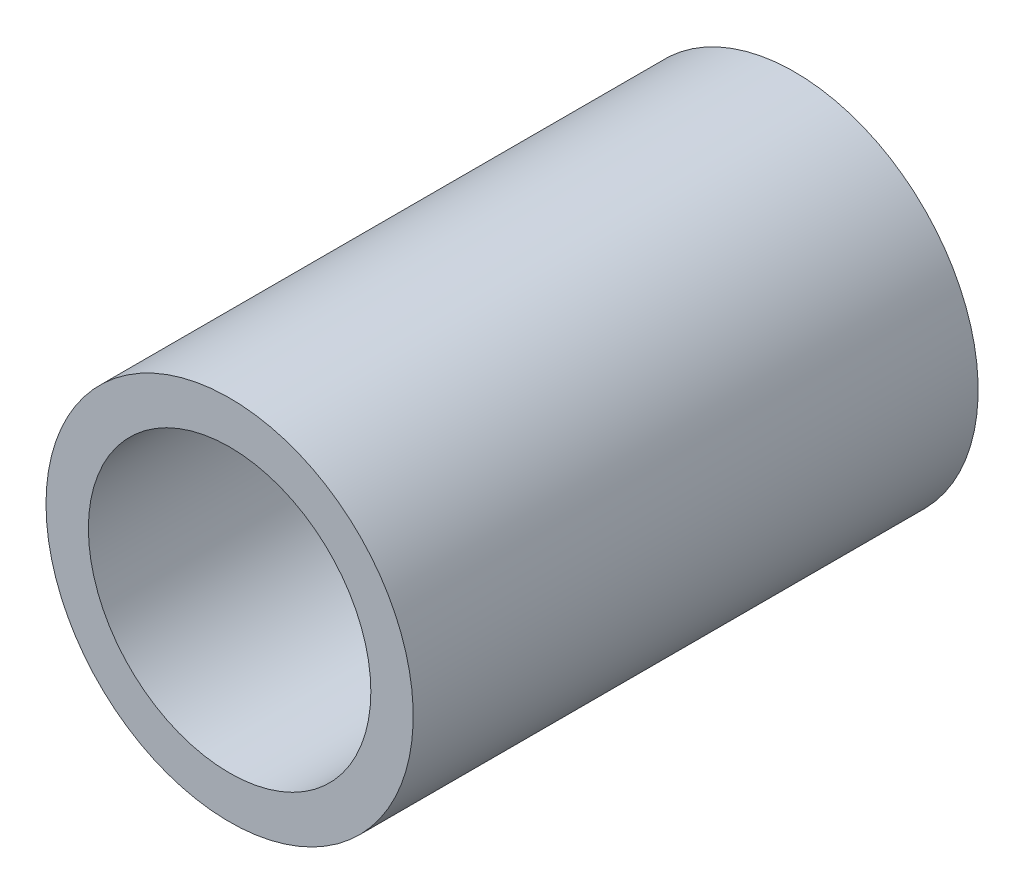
ISO-10303-21;
HEADER;
FILE_DESCRIPTION(('STEP AP214'),'2;1');
FILE_NAME('part.step','',(''),(''),'','','');
FILE_SCHEMA(('AUTOMOTIVE_DESIGN { 1 0 10303 214 1 1 1 1 }'));
ENDSEC;
DATA;
#1=APPLICATION_CONTEXT('core data for automotive mechanical design processes');
#2=APPLICATION_PROTOCOL_DEFINITION('international standard','automotive_design',2000,#1);
#3=PRODUCT_CONTEXT('',#1,'mechanical');
#4=PRODUCT('Part','Part','',(#3));
#5=PRODUCT_RELATED_PRODUCT_CATEGORY('part','',(#4));
#6=PRODUCT_DEFINITION_FORMATION('','',#4);
#7=PRODUCT_DEFINITION_CONTEXT('part definition',#1,'design');
#8=PRODUCT_DEFINITION('design','',#6,#7);
#9=PRODUCT_DEFINITION_SHAPE('','',#8);
#10=(LENGTH_UNIT() NAMED_UNIT(*) SI_UNIT(.MILLI.,.METRE.));
#11=(NAMED_UNIT(*) PLANE_ANGLE_UNIT() SI_UNIT($,.RADIAN.));
#12=(NAMED_UNIT(*) SI_UNIT($,.STERADIAN.) SOLID_ANGLE_UNIT());
#13=UNCERTAINTY_MEASURE_WITH_UNIT(LENGTH_MEASURE(1.E-05),#10,'distance_accuracy_value','');
#14=(GEOMETRIC_REPRESENTATION_CONTEXT(3) GLOBAL_UNCERTAINTY_ASSIGNED_CONTEXT((#13)) GLOBAL_UNIT_ASSIGNED_CONTEXT((#10,
#11,#12)) REPRESENTATION_CONTEXT('',''));
#15=CARTESIAN_POINT('',(0.,0.,0.));
#16=DIRECTION('',(0.,0.,1.));
#17=DIRECTION('',(1.,0.,0.));
#18=AXIS2_PLACEMENT_3D('',#15,#16,#17);
#19=CARTESIAN_POINT('',(0.,0.,40.));
#20=DIRECTION('',(0.,0.,0.999999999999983));
#21=DIRECTION('',(0.999999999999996,0.,0.));
#22=AXIS2_PLACEMENT_3D('',#19,#20,#21);
#23=PLANE('',#22);
#24=CARTESIAN_POINT('',(0.,0.,40.));
#25=DIRECTION('',(0.,0.,0.999999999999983));
#26=DIRECTION('',(0.999999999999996,0.,0.));
#27=AXIS2_PLACEMENT_3D('',#24,#25,#26);
#28=CIRCLE('',#27,13.);
#29=CARTESIAN_POINT('',(-13.,0.,40.));
#30=VERTEX_POINT('',#29);
#31=EDGE_CURVE('E10',#30,#30,#28,.T.);
#32=ORIENTED_EDGE('',*,*,#31,.T.);
#33=EDGE_LOOP('',(#32));
#34=FACE_BOUND('',#33,.T.);
#35=CARTESIAN_POINT('',(0.,0.,40.));
#36=DIRECTION('',(0.,0.,0.999999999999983));
#37=DIRECTION('',(0.999999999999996,0.,0.));
#38=AXIS2_PLACEMENT_3D('',#35,#36,#37);
#39=CIRCLE('',#38,10.);
#40=CARTESIAN_POINT('',(-9.99999999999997,0.,40.));
#41=VERTEX_POINT('',#40);
#42=EDGE_CURVE('E48',#41,#41,#39,.T.);
#43=ORIENTED_EDGE('',*,*,#42,.F.);
#44=EDGE_LOOP('',(#43));
#45=FACE_BOUND('',#44,.T.);
#46=ADVANCED_FACE('F34',(#34,#45),#23,.T.);
#47=CARTESIAN_POINT('',(0.,0.,0.));
#48=DIRECTION('',(0.,0.,0.999999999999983));
#49=DIRECTION('',(0.999999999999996,0.,0.));
#50=AXIS2_PLACEMENT_3D('',#47,#48,#49);
#51=PLANE('',#50);
#52=CARTESIAN_POINT('',(0.,0.,0.));
#53=DIRECTION('',(0.,0.,0.999999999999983));
#54=DIRECTION('',(0.999999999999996,0.,0.));
#55=AXIS2_PLACEMENT_3D('',#52,#53,#54);
#56=CIRCLE('',#55,13.);
#57=CARTESIAN_POINT('',(-13.,0.,0.));
#58=VERTEX_POINT('',#57);
#59=EDGE_CURVE('E38',#58,#58,#56,.T.);
#60=ORIENTED_EDGE('',*,*,#59,.F.);
#61=EDGE_LOOP('',(#60));
#62=FACE_BOUND('',#61,.T.);
#63=CARTESIAN_POINT('',(0.,0.,0.));
#64=DIRECTION('',(0.,0.,0.999999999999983));
#65=DIRECTION('',(0.999999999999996,0.,0.));
#66=AXIS2_PLACEMENT_3D('',#63,#64,#65);
#67=CIRCLE('',#66,10.);
#68=CARTESIAN_POINT('',(-9.99999999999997,0.,0.));
#69=VERTEX_POINT('',#68);
#70=EDGE_CURVE('E50',#69,#69,#67,.T.);
#71=ORIENTED_EDGE('',*,*,#70,.T.);
#72=EDGE_LOOP('',(#71));
#73=FACE_BOUND('',#72,.T.);
#74=ADVANCED_FACE('F63',(#62,#73),#51,.F.);
#75=CARTESIAN_POINT('',(0.,0.,40.));
#76=DIRECTION('',(0.,0.,-0.999999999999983));
#77=DIRECTION('',(-0.999999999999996,0.,0.));
#78=AXIS2_PLACEMENT_3D('',#75,#76,#77);
#79=CYLINDRICAL_SURFACE('',#78,13.);
#80=CARTESIAN_POINT('',(-13.,0.,40.));
#81=CARTESIAN_POINT('',(-13.,0.,39.5833333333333));
#82=CARTESIAN_POINT('',(-13.,0.,39.1666666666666));
#83=CARTESIAN_POINT('',(-13.,0.,38.3333333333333));
#84=CARTESIAN_POINT('',(-13.,0.,37.9166666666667));
#85=CARTESIAN_POINT('',(-13.,0.,37.0833333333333));
#86=CARTESIAN_POINT('',(-13.,0.,36.6666666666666));
#87=CARTESIAN_POINT('',(-13.,0.,35.8333333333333));
#88=CARTESIAN_POINT('',(-13.,0.,35.4166666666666));
#89=CARTESIAN_POINT('',(-13.,0.,34.5833333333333));
#90=CARTESIAN_POINT('',(-13.,0.,34.1666666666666));
#91=CARTESIAN_POINT('',(-13.,0.,33.3333333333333));
#92=CARTESIAN_POINT('',(-13.,0.,32.9166666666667));
#93=CARTESIAN_POINT('',(-13.,0.,32.0833333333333));
#94=CARTESIAN_POINT('',(-13.,0.,31.6666666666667));
#95=CARTESIAN_POINT('',(-13.,0.,30.8333333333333));
#96=CARTESIAN_POINT('',(-13.,0.,30.4166666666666));
#97=CARTESIAN_POINT('',(-13.,0.,29.5833333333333));
#98=CARTESIAN_POINT('',(-13.,0.,29.1666666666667));
#99=CARTESIAN_POINT('',(-13.,0.,28.3333333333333));
#100=CARTESIAN_POINT('',(-13.,0.,27.9166666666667));
#101=CARTESIAN_POINT('',(-13.,0.,27.0833333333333));
#102=CARTESIAN_POINT('',(-13.,0.,26.6666666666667));
#103=CARTESIAN_POINT('',(-13.,0.,25.8333333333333));
#104=CARTESIAN_POINT('',(-13.,0.,25.4166666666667));
#105=CARTESIAN_POINT('',(-13.,0.,24.5833333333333));
#106=CARTESIAN_POINT('',(-13.,0.,24.1666666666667));
#107=CARTESIAN_POINT('',(-13.,0.,23.3333333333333));
#108=CARTESIAN_POINT('',(-13.,0.,22.9166666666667));
#109=CARTESIAN_POINT('',(-13.,0.,22.0833333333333));
#110=CARTESIAN_POINT('',(-13.,0.,21.6666666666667));
#111=CARTESIAN_POINT('',(-13.,0.,20.8333333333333));
#112=CARTESIAN_POINT('',(-13.,0.,20.4166666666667));
#113=CARTESIAN_POINT('',(-13.,0.,19.5833333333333));
#114=CARTESIAN_POINT('',(-13.,0.,19.1666666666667));
#115=CARTESIAN_POINT('',(-13.,0.,18.3333333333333));
#116=CARTESIAN_POINT('',(-13.,0.,17.9166666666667));
#117=CARTESIAN_POINT('',(-13.,0.,17.0833333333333));
#118=CARTESIAN_POINT('',(-13.,0.,16.6666666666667));
#119=CARTESIAN_POINT('',(-13.,0.,15.8333333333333));
#120=CARTESIAN_POINT('',(-13.,0.,15.4166666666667));
#121=CARTESIAN_POINT('',(-13.,0.,14.5833333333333));
#122=CARTESIAN_POINT('',(-13.,0.,14.1666666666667));
#123=CARTESIAN_POINT('',(-13.,0.,13.3333333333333));
#124=CARTESIAN_POINT('',(-13.,0.,12.9166666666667));
#125=CARTESIAN_POINT('',(-13.,0.,12.0833333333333));
#126=CARTESIAN_POINT('',(-13.,0.,11.6666666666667));
#127=CARTESIAN_POINT('',(-13.,0.,10.8333333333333));
#128=CARTESIAN_POINT('',(-13.,0.,10.4166666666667));
#129=CARTESIAN_POINT('',(-13.,0.,9.58333333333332));
#130=CARTESIAN_POINT('',(-13.,0.,9.16666666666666));
#131=CARTESIAN_POINT('',(-13.,0.,8.33333333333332));
#132=CARTESIAN_POINT('',(-13.,0.,7.91666666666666));
#133=CARTESIAN_POINT('',(-13.,0.,7.08333333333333));
#134=CARTESIAN_POINT('',(-13.,0.,6.66666666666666));
#135=CARTESIAN_POINT('',(-13.,0.,5.83333333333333));
#136=CARTESIAN_POINT('',(-13.,0.,5.41666666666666));
#137=CARTESIAN_POINT('',(-13.,0.,4.58333333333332));
#138=CARTESIAN_POINT('',(-13.,0.,4.16666666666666));
#139=CARTESIAN_POINT('',(-13.,0.,3.33333333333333));
#140=CARTESIAN_POINT('',(-13.,0.,2.91666666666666));
#141=CARTESIAN_POINT('',(-13.,0.,2.08333333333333));
#142=CARTESIAN_POINT('',(-13.,0.,1.66666666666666));
#143=CARTESIAN_POINT('',(-13.,0.,0.833333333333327));
#144=CARTESIAN_POINT('',(-13.,0.,0.41666666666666));
#145=CARTESIAN_POINT('',(-13.,0.,0.));
#146=B_SPLINE_CURVE_WITH_KNOTS('',3,(#80,#81,#82,#83,#84,#85,#86,#87,#88,#89,#90,#91,#92,#93,
#94,#95,#96,#97,#98,#99,#100,#101,#102,#103,#104,#105,#106,#107,#108,#109,#110,#111,#112,#113,
#114,#115,#116,#117,#118,#119,#120,#121,#122,#123,#124,#125,#126,#127,#128,#129,#130,#131,#132,
#133,#134,#135,#136,#137,#138,#139,#140,#141,#142,#143,#144,#145),.UNSPECIFIED.,.F.,.F.,(4,2,2,
2,2,2,2,2,2,2,2,2,2,2,2,2,2,2,2,2,2,2,2,2,2,2,2,2,2,2,2,2,4),(0.,1.24999999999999,2.5,3.75,5.,
6.24999999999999,7.49999999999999,8.74999999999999,9.99999999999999,11.25,12.5,13.75,15.,16.25,
17.5,18.75,20.,21.25,22.5,23.75,25.,26.25,27.5,28.75,30.,31.25,32.5,33.75,35.,36.25,37.5,38.75,
40.),.UNSPECIFIED.);
#147=EDGE_CURVE('BSEAM36',#30,#58,#146,.T.);
#148=ORIENTED_EDGE('',*,*,#31,.F.);
#149=ORIENTED_EDGE('',*,*,#59,.T.);
#150=ORIENTED_EDGE('',*,*,#147,.T.);
#151=ORIENTED_EDGE('',*,*,#147,.F.);
#152=EDGE_LOOP('',(#148,#150,#149,#151));
#153=FACE_BOUND('',#152,.T.);
#154=ADVANCED_FACE('F36',(#153),#79,.T.);
#155=CARTESIAN_POINT('',(0.,0.,40.));
#156=DIRECTION('',(0.,0.,-0.999999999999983));
#157=DIRECTION('',(-0.999999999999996,0.,0.));
#158=AXIS2_PLACEMENT_3D('',#155,#156,#157);
#159=CYLINDRICAL_SURFACE('',#158,10.);
#160=CARTESIAN_POINT('',(-9.99999999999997,0.,40.));
#161=CARTESIAN_POINT('',(-9.99999999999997,0.,39.5833333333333));
#162=CARTESIAN_POINT('',(-9.99999999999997,0.,39.1666666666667));
#163=CARTESIAN_POINT('',(-9.99999999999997,0.,38.3333333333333));
#164=CARTESIAN_POINT('',(-9.99999999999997,0.,37.9166666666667));
#165=CARTESIAN_POINT('',(-9.99999999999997,0.,37.0833333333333));
#166=CARTESIAN_POINT('',(-9.99999999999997,0.,36.6666666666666));
#167=CARTESIAN_POINT('',(-9.99999999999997,0.,35.8333333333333));
#168=CARTESIAN_POINT('',(-9.99999999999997,0.,35.4166666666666));
#169=CARTESIAN_POINT('',(-9.99999999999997,0.,34.5833333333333));
#170=CARTESIAN_POINT('',(-9.99999999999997,0.,34.1666666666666));
#171=CARTESIAN_POINT('',(-9.99999999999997,0.,33.3333333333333));
#172=CARTESIAN_POINT('',(-9.99999999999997,0.,32.9166666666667));
#173=CARTESIAN_POINT('',(-9.99999999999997,0.,32.0833333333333));
#174=CARTESIAN_POINT('',(-9.99999999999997,0.,31.6666666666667));
#175=CARTESIAN_POINT('',(-9.99999999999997,0.,30.8333333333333));
#176=CARTESIAN_POINT('',(-9.99999999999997,0.,30.4166666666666));
#177=CARTESIAN_POINT('',(-9.99999999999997,0.,29.5833333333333));
#178=CARTESIAN_POINT('',(-9.99999999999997,0.,29.1666666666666));
#179=CARTESIAN_POINT('',(-9.99999999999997,0.,28.3333333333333));
#180=CARTESIAN_POINT('',(-9.99999999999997,0.,27.9166666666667));
#181=CARTESIAN_POINT('',(-9.99999999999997,0.,27.0833333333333));
#182=CARTESIAN_POINT('',(-9.99999999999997,0.,26.6666666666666));
#183=CARTESIAN_POINT('',(-9.99999999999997,0.,25.8333333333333));
#184=CARTESIAN_POINT('',(-9.99999999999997,0.,25.4166666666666));
#185=CARTESIAN_POINT('',(-9.99999999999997,0.,24.5833333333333));
#186=CARTESIAN_POINT('',(-9.99999999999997,0.,24.1666666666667));
#187=CARTESIAN_POINT('',(-9.99999999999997,0.,23.3333333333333));
#188=CARTESIAN_POINT('',(-9.99999999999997,0.,22.9166666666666));
#189=CARTESIAN_POINT('',(-9.99999999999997,0.,22.0833333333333));
#190=CARTESIAN_POINT('',(-9.99999999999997,0.,21.6666666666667));
#191=CARTESIAN_POINT('',(-9.99999999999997,0.,20.8333333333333));
#192=CARTESIAN_POINT('',(-9.99999999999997,0.,20.4166666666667));
#193=CARTESIAN_POINT('',(-9.99999999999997,0.,19.5833333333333));
#194=CARTESIAN_POINT('',(-9.99999999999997,0.,19.1666666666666));
#195=CARTESIAN_POINT('',(-9.99999999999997,0.,18.3333333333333));
#196=CARTESIAN_POINT('',(-9.99999999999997,0.,17.9166666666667));
#197=CARTESIAN_POINT('',(-9.99999999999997,0.,17.0833333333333));
#198=CARTESIAN_POINT('',(-9.99999999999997,0.,16.6666666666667));
#199=CARTESIAN_POINT('',(-9.99999999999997,0.,15.8333333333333));
#200=CARTESIAN_POINT('',(-9.99999999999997,0.,15.4166666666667));
#201=CARTESIAN_POINT('',(-9.99999999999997,0.,14.5833333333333));
#202=CARTESIAN_POINT('',(-9.99999999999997,0.,14.1666666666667));
#203=CARTESIAN_POINT('',(-9.99999999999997,0.,13.3333333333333));
#204=CARTESIAN_POINT('',(-9.99999999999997,0.,12.9166666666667));
#205=CARTESIAN_POINT('',(-9.99999999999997,0.,12.0833333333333));
#206=CARTESIAN_POINT('',(-9.99999999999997,0.,11.6666666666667));
#207=CARTESIAN_POINT('',(-9.99999999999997,0.,10.8333333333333));
#208=CARTESIAN_POINT('',(-9.99999999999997,0.,10.4166666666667));
#209=CARTESIAN_POINT('',(-9.99999999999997,0.,9.58333333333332));
#210=CARTESIAN_POINT('',(-9.99999999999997,0.,9.16666666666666));
#211=CARTESIAN_POINT('',(-9.99999999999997,0.,8.33333333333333));
#212=CARTESIAN_POINT('',(-9.99999999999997,0.,7.91666666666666));
#213=CARTESIAN_POINT('',(-9.99999999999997,0.,7.08333333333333));
#214=CARTESIAN_POINT('',(-9.99999999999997,0.,6.66666666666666));
#215=CARTESIAN_POINT('',(-9.99999999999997,0.,5.83333333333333));
#216=CARTESIAN_POINT('',(-9.99999999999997,0.,5.41666666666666));
#217=CARTESIAN_POINT('',(-9.99999999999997,0.,4.58333333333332));
#218=CARTESIAN_POINT('',(-9.99999999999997,0.,4.16666666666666));
#219=CARTESIAN_POINT('',(-9.99999999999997,0.,3.33333333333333));
#220=CARTESIAN_POINT('',(-9.99999999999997,0.,2.91666666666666));
#221=CARTESIAN_POINT('',(-9.99999999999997,0.,2.08333333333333));
#222=CARTESIAN_POINT('',(-9.99999999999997,0.,1.66666666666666));
#223=CARTESIAN_POINT('',(-9.99999999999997,0.,0.833333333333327));
#224=CARTESIAN_POINT('',(-9.99999999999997,0.,0.41666666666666));
#225=CARTESIAN_POINT('',(-9.99999999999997,0.,0.));
#226=B_SPLINE_CURVE_WITH_KNOTS('',3,(#160,#161,#162,#163,#164,#165,#166,#167,#168,#169,#170,
#171,#172,#173,#174,#175,#176,#177,#178,#179,#180,#181,#182,#183,#184,#185,#186,#187,#188,#189,
#190,#191,#192,#193,#194,#195,#196,#197,#198,#199,#200,#201,#202,#203,#204,#205,#206,#207,#208,
#209,#210,#211,#212,#213,#214,#215,#216,#217,#218,#219,#220,#221,#222,#223,#224,#225),
.UNSPECIFIED.,.F.,.F.,(4,2,2,2,2,2,2,2,2,2,2,2,2,2,2,2,2,2,2,2,2,2,2,2,2,2,2,2,2,2,2,2,4),(0.,
1.25,2.5,3.75,5.,6.25,7.5,8.75,10.,11.25,12.5,13.75,15.,16.25,17.5,18.75,20.,21.25,22.5,23.75,
25.,26.25,27.5,28.75,30.,31.25,32.5,33.75,35.,36.25,37.5,38.75,40.),.UNSPECIFIED.);
#227=EDGE_CURVE('BSEAM59',#41,#69,#226,.T.);
#228=ORIENTED_EDGE('',*,*,#42,.T.);
#229=ORIENTED_EDGE('',*,*,#70,.F.);
#230=ORIENTED_EDGE('',*,*,#227,.T.);
#231=ORIENTED_EDGE('',*,*,#227,.F.);
#232=EDGE_LOOP('',(#228,#230,#229,#231));
#233=FACE_BOUND('',#232,.T.);
#234=ADVANCED_FACE('F59',(#233),#159,.F.);
#235=CLOSED_SHELL('',(#46,#74,#154,#234));
#236=MANIFOLD_SOLID_BREP('B2',#235);
#237=ADVANCED_BREP_SHAPE_REPRESENTATION('',(#18,#236),#14);
#238=SHAPE_DEFINITION_REPRESENTATION(#9,#237);
ENDSEC;
END-ISO-10303-21;
